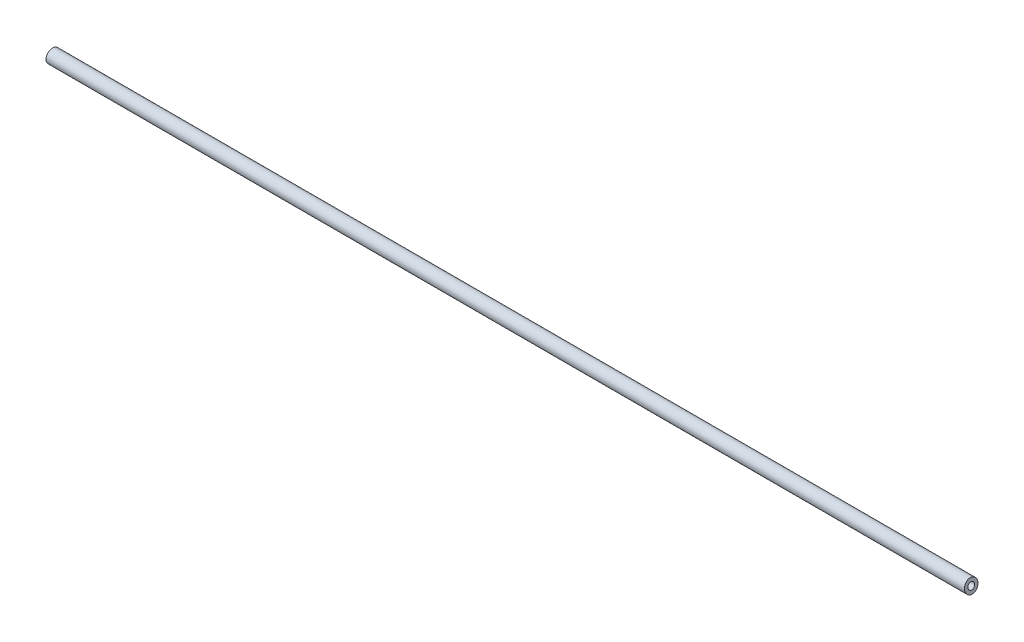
ISO-10303-21;
HEADER;
FILE_DESCRIPTION(('STEP AP214'),'2;1');
FILE_NAME('part.step','',(''),(''),'','','');
FILE_SCHEMA(('AUTOMOTIVE_DESIGN { 1 0 10303 214 1 1 1 1 }'));
ENDSEC;
DATA;
#1=APPLICATION_CONTEXT('core data for automotive mechanical design processes');
#2=APPLICATION_PROTOCOL_DEFINITION('international standard','automotive_design',2000,#1);
#3=PRODUCT_CONTEXT('',#1,'mechanical');
#4=PRODUCT('Part','Part','',(#3));
#5=PRODUCT_RELATED_PRODUCT_CATEGORY('part','',(#4));
#6=PRODUCT_DEFINITION_FORMATION('','',#4);
#7=PRODUCT_DEFINITION_CONTEXT('part definition',#1,'design');
#8=PRODUCT_DEFINITION('design','',#6,#7);
#9=PRODUCT_DEFINITION_SHAPE('','',#8);
#10=(LENGTH_UNIT() NAMED_UNIT(*) SI_UNIT(.MILLI.,.METRE.));
#11=(NAMED_UNIT(*) PLANE_ANGLE_UNIT() SI_UNIT($,.RADIAN.));
#12=(NAMED_UNIT(*) SI_UNIT($,.STERADIAN.) SOLID_ANGLE_UNIT());
#13=UNCERTAINTY_MEASURE_WITH_UNIT(LENGTH_MEASURE(1.E-05),#10,'distance_accuracy_value','');
#14=(GEOMETRIC_REPRESENTATION_CONTEXT(3) GLOBAL_UNCERTAINTY_ASSIGNED_CONTEXT((#13)) GLOBAL_UNIT_ASSIGNED_CONTEXT((#10,
#11,#12)) REPRESENTATION_CONTEXT('',''));
#15=CARTESIAN_POINT('',(0.,0.,0.));
#16=DIRECTION('',(0.,0.,1.));
#17=DIRECTION('',(1.,0.,0.));
#18=AXIS2_PLACEMENT_3D('',#15,#16,#17);
#19=CARTESIAN_POINT('',(0.,0.,0.));
#20=DIRECTION('',(1.,0.,0.));
#21=DIRECTION('',(0.,0.,-1.));
#22=AXIS2_PLACEMENT_3D('',#19,#20,#21);
#23=CYLINDRICAL_SURFACE('',#22,2.00000000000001);
#24=CARTESIAN_POINT('',(214.701097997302,0.,0.));
#25=DIRECTION('',(-0.989015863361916,-0.147809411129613,0.));
#26=DIRECTION('',(0.147809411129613,-0.989015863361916,0.));
#27=AXIS2_PLACEMENT_3D('',#24,#25,#26);
#28=ELLIPSE('',#27,2.02221225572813,2.00000000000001);
#29=CARTESIAN_POINT('',(215.,-2.00000000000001,0.));
#30=VERTEX_POINT('',#29);
#31=EDGE_CURVE('E42',#30,#30,#28,.F.);
#32=ORIENTED_EDGE('',*,*,#31,.F.);
#33=EDGE_LOOP('',(#32));
#34=FACE_BOUND('',#33,.T.);
#35=CARTESIAN_POINT('',(-60.,0.,0.));
#36=DIRECTION('',(1.,0.,0.));
#37=DIRECTION('',(0.,0.,-1.));
#38=AXIS2_PLACEMENT_3D('',#35,#36,#37);
#39=CIRCLE('',#38,1.99999999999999);
#40=CARTESIAN_POINT('',(-60.,0.,-1.99999999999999));
#41=VERTEX_POINT('',#40);
#42=EDGE_CURVE('E34',#41,#41,#39,.T.);
#43=ORIENTED_EDGE('',*,*,#42,.T.);
#44=EDGE_LOOP('',(#43));
#45=FACE_BOUND('',#44,.T.);
#46=ADVANCED_FACE('F28',(#34,#45),#23,.T.);
#47=CARTESIAN_POINT('',(-60.,0.999999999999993,0.));
#48=DIRECTION('',(-1.,0.,0.));
#49=DIRECTION('',(0.,0.,1.));
#50=AXIS2_PLACEMENT_3D('',#47,#48,#49);
#51=PLANE('',#50);
#52=CARTESIAN_POINT('',(-60.,0.,0.));
#53=DIRECTION('',(1.,0.,0.));
#54=DIRECTION('',(0.,0.,-1.));
#55=AXIS2_PLACEMENT_3D('',#52,#53,#54);
#56=CIRCLE('',#55,0.999999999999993);
#57=CARTESIAN_POINT('',(-60.,0.,-0.999999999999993));
#58=VERTEX_POINT('',#57);
#59=EDGE_CURVE('E38',#58,#58,#56,.T.);
#60=ORIENTED_EDGE('',*,*,#59,.T.);
#61=EDGE_LOOP('',(#60));
#62=FACE_BOUND('',#61,.T.);
#63=ORIENTED_EDGE('',*,*,#42,.F.);
#64=EDGE_LOOP('',(#63));
#65=FACE_BOUND('',#64,.T.);
#66=ADVANCED_FACE('F51',(#62,#65),#51,.T.);
#67=CARTESIAN_POINT('',(0.,0.,0.));
#68=DIRECTION('',(1.,0.,0.));
#69=DIRECTION('',(0.,0.,-1.));
#70=AXIS2_PLACEMENT_3D('',#67,#68,#69);
#71=CYLINDRICAL_SURFACE('',#70,1.00000000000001);
#72=CARTESIAN_POINT('',(214.701097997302,0.,0.));
#73=DIRECTION('',(-0.989015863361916,-0.147809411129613,0.));
#74=DIRECTION('',(0.147809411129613,-0.989015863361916,0.));
#75=AXIS2_PLACEMENT_3D('',#72,#73,#74);
#76=ELLIPSE('',#75,1.01110612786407,1.00000000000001);
#77=CARTESIAN_POINT('',(214.850548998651,-1.00000000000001,0.));
#78=VERTEX_POINT('',#77);
#79=EDGE_CURVE('E10',#78,#78,#76,.T.);
#80=ORIENTED_EDGE('',*,*,#79,.F.);
#81=EDGE_LOOP('',(#80));
#82=FACE_BOUND('',#81,.T.);
#83=ORIENTED_EDGE('',*,*,#59,.F.);
#84=EDGE_LOOP('',(#83));
#85=FACE_BOUND('',#84,.T.);
#86=ADVANCED_FACE('F55',(#82,#85),#71,.F.);
#87=CARTESIAN_POINT('',(215.,-2.,346.322719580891));
#88=DIRECTION('',(-0.989015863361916,-0.147809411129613,0.));
#89=DIRECTION('',(0.147809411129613,-0.989015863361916,0.));
#90=AXIS2_PLACEMENT_3D('',#87,#88,#89);
#91=PLANE('',#90);
#92=ORIENTED_EDGE('',*,*,#79,.T.);
#93=EDGE_LOOP('',(#92));
#94=FACE_BOUND('',#93,.T.);
#95=ORIENTED_EDGE('',*,*,#31,.T.);
#96=EDGE_LOOP('',(#95));
#97=FACE_BOUND('',#96,.T.);
#98=ADVANCED_FACE('F48',(#94,#97),#91,.F.);
#99=CLOSED_SHELL('',(#46,#66,#86,#98));
#100=MANIFOLD_SOLID_BREP('B2',#99);
#101=ADVANCED_BREP_SHAPE_REPRESENTATION('',(#18,#100),#14);
#102=SHAPE_DEFINITION_REPRESENTATION(#9,#101);
ENDSEC;
END-ISO-10303-21;
